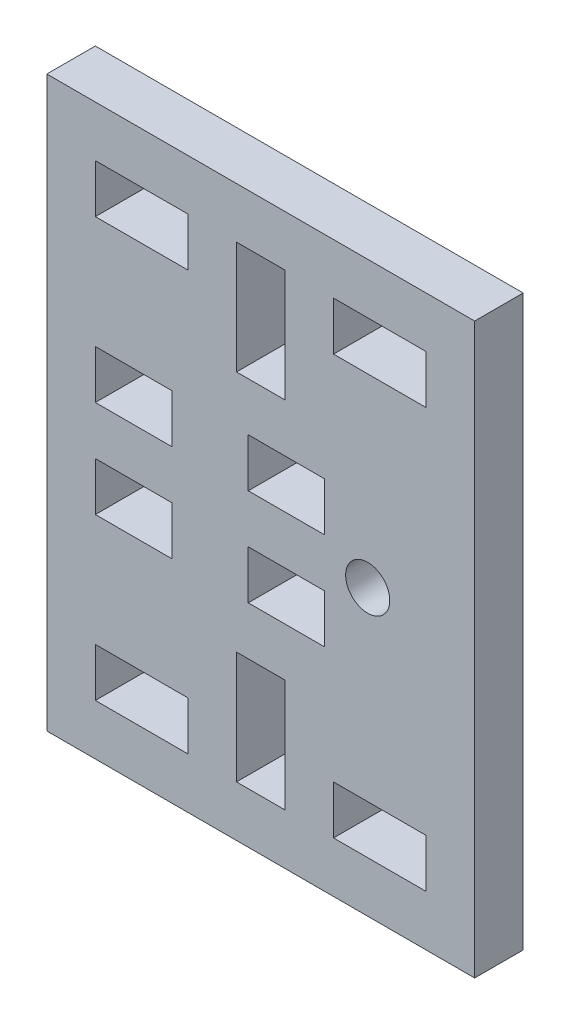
from build123d import *

# Parameters (mm, degrees)
SKETCH1_R           = 2.5
SKETCH1_W           = 10.5
SKETCH1_H           = 5.5
SKETCH1_W_2         = 5.5
SKETCH1_H_2         = 12.75
SKETCH1_W_3         = 8.666666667
BOSS_EXTRUDE1_DEPTH = 5.5


with BuildPart() as part:
    # Sketch1 → Boss-Extrude1 (new body)
    with BuildSketch(Plane.XY):
        Polygon((-2.179681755, 31.848630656), (46.320318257, 31.848630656), (46.320318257, -32.651369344), (-2.179681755, -32.651369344), (-2.179681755, -21.401369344), (-2.179681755, 20.598630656), align=None)
        with Locations((34.195318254, -0.401369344)):
            Circle(SKETCH1_R, mode=Mode.SUBTRACT)
        with Locations((35.570318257, -24.151369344)):
            Rectangle(SKETCH1_W, SKETCH1_H, mode=Mode.SUBTRACT)
        with Locations((8.570318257, 23.348630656)):
            Rectangle(SKETCH1_W, SKETCH1_H, mode=Mode.SUBTRACT)
        with Locations((22.070318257, 19.723630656)):
            Rectangle(SKETCH1_W_2, SKETCH1_H_2, mode=Mode.SUBTRACT)
        with Locations((35.570318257, 23.348630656)):
            Rectangle(SKETCH1_W, SKETCH1_H, mode=Mode.SUBTRACT)
        with Locations((7.653651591, 5.098630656)):
            Rectangle(SKETCH1_W_3, SKETCH1_H, mode=Mode.SUBTRACT)
        with Locations((24.986984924, 5.098630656)):
            Rectangle(SKETCH1_W_3, SKETCH1_H, mode=Mode.SUBTRACT)
        with Locations((7.653651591, -5.901369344)):
            Rectangle(SKETCH1_W_3, SKETCH1_H, mode=Mode.SUBTRACT)
        with Locations((24.986984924, -5.901369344)):
            Rectangle(SKETCH1_W_3, SKETCH1_H, mode=Mode.SUBTRACT)
        with Locations((8.570318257, -24.151369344)):
            Rectangle(SKETCH1_W, SKETCH1_H, mode=Mode.SUBTRACT)
        with Locations((22.070318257, -20.526369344)):
            Rectangle(SKETCH1_W_2, SKETCH1_H_2, mode=Mode.SUBTRACT)
    extrude(amount=BOSS_EXTRUDE1_DEPTH)


solid = part.part
